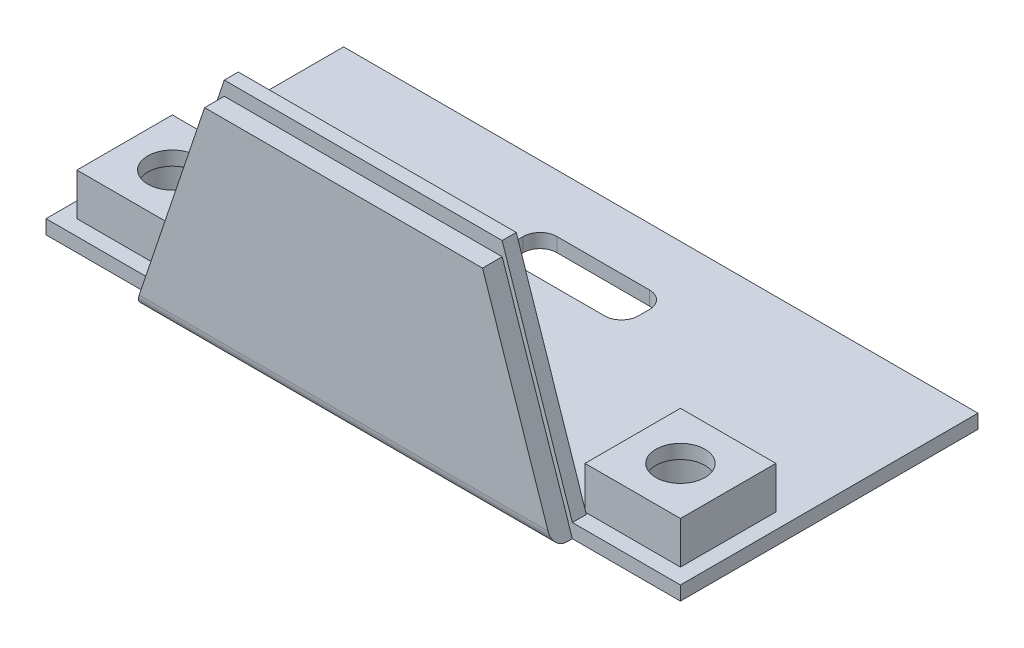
from build123d import *

# Parameters (mm, degrees)
SKIZZE1_W                       = 45.2
SKIZZE1_H                       = 21.2
AUFSATZ_LINEAR_AUSTRAGEN1_DEPTH = 1
AUFSATZ_LINEAR_AUSTRAGEN2_DEPTH = 1.4
AUFSATZ_LINEAR_AUSTRAGEN3_DEPTH = 1
SKIZZE4_W                       = 6.8
SKIZZE4_H                       = 6.8
SKIZZE4_R                       = 1.75
AUFSATZ_LINEAR_AUSTRAGEN4_DEPTH = 3
SCHNITT_LINEAR_START            = -1
SKIZZE5_R                       = 3
SCHNITT_LINEAR_AUSTRAGEN1_DEPTH = 3
SCHNITT_LINEAR_AUSTRAGEN2_DEPTH = 1
VERRUNDUNG1_R                   = 1


with BuildPart() as part:
    # Skizze1 → Aufsatz-Linear austragen1 (new body)
    with BuildSketch(Plane(origin=(0, 0, 0), x_dir=(1, 0, 0), z_dir=(0, 1, 0))):
        Rectangle(SKIZZE1_W, SKIZZE1_H)
    extrude(amount=AUFSATZ_LINEAR_AUSTRAGEN1_DEPTH)

    # Skizze2 → Aufsatz-Linear austragen2 (add)
    with BuildSketch(Plane.XY.offset(10.6)):
        Polygon((9.9, 14.9), (-9.9, 14.9), (-14.9, 0), (14.9, 0), align=None)
    extrude(amount=AUFSATZ_LINEAR_AUSTRAGEN2_DEPTH)

    # Skizze3 → Aufsatz-Linear austragen3 (add)
    with BuildSketch(Plane(origin=(0, 0, 10.6), x_dir=(-1, 0, 0), z_dir=(0, 0, -1))):
        Polygon((-14.56442953, 1), (14.56442953, 1), (14.9, 1), (9.9, 15.9), (-9.9, 15.9), (-14.9, 1), align=None)
    extrude(amount=AUFSATZ_LINEAR_AUSTRAGEN3_DEPTH)

    # Skizze4 → Aufsatz-Linear austragen4 (add)
    with BuildSketch(Plane(origin=(0, 1, 0), x_dir=(1, 0, 0), z_dir=(0, 1, 0))):
        with Locations((18.1, -6.1)):
            Rectangle(SKIZZE4_W, SKIZZE4_H)
        with Locations(Location((18.1, -6.1, 0), (0, 0, 270))):
            Circle(SKIZZE4_R, mode=Mode.SUBTRACT)
    aufsatz_linear_austragen4 = extrude(amount=AUFSATZ_LINEAR_AUSTRAGEN4_DEPTH)

    # Skizze5 → Schnitt-Linear austragen1 (cut)
    with BuildSketch(Plane(origin=(0, 1, 0), x_dir=(1, 0, 0), z_dir=(0, 1, 0)).offset(SCHNITT_LINEAR_START)):
        with Locations(Location((18.1, -6.1, 0), (0, 0, 270))):
            Circle(SKIZZE5_R)
    schnitt_linear_austragen1 = extrude(amount=SCHNITT_LINEAR_AUSTRAGEN1_DEPTH, mode=Mode.SUBTRACT)

    # Spiegeln1: Aufsatz-Linear austragen4, Schnitt-Linear austragen1 across plane
    add(aufsatz_linear_austragen4.mirror(Plane(origin=(0, 0, 0), x_dir=(0, 0, 1), z_dir=(1, 0, 0))))
    add(schnitt_linear_austragen1.mirror(Plane(origin=(0, 0, 0), x_dir=(0, 0, 1), z_dir=(1, 0, 0))), mode=Mode.SUBTRACT)

    # Skizze6 → Schnitt-Linear austragen2 (cut)
    with BuildSketch(Plane.XZ):
        with BuildLine():
            Line((-3.3, -6.5), (3.3, -6.5))
            ThreePointArc((3.3, -6.5), (4.148528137, -6.148528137), (4.5, -5.3))
            Line((4.5, -5.3), (4.5, -4.5))
            ThreePointArc((4.5, -4.5), (4.148528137, -3.651471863), (3.3, -3.3))
            Line((3.3, -3.3), (-3.3, -3.3))
            ThreePointArc((-3.3, -3.3), (-4.148528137, -3.651471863), (-4.5, -4.5))
            Line((-4.5, -4.5), (-4.5, -5.3))
            ThreePointArc((-4.5, -5.3), (-4.148528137, -6.148528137), (-3.3, -6.5))
        make_face()
    extrude(amount=-SCHNITT_LINEAR_AUSTRAGEN2_DEPTH, mode=Mode.SUBTRACT)

    # Verrundung1
    verrundung1_edges = [part.edges().sort_by_distance(p)[0] for p in [
        (0, 0, 12),
    ]]
    fillet(verrundung1_edges, radius=VERRUNDUNG1_R)


solid = part.part
